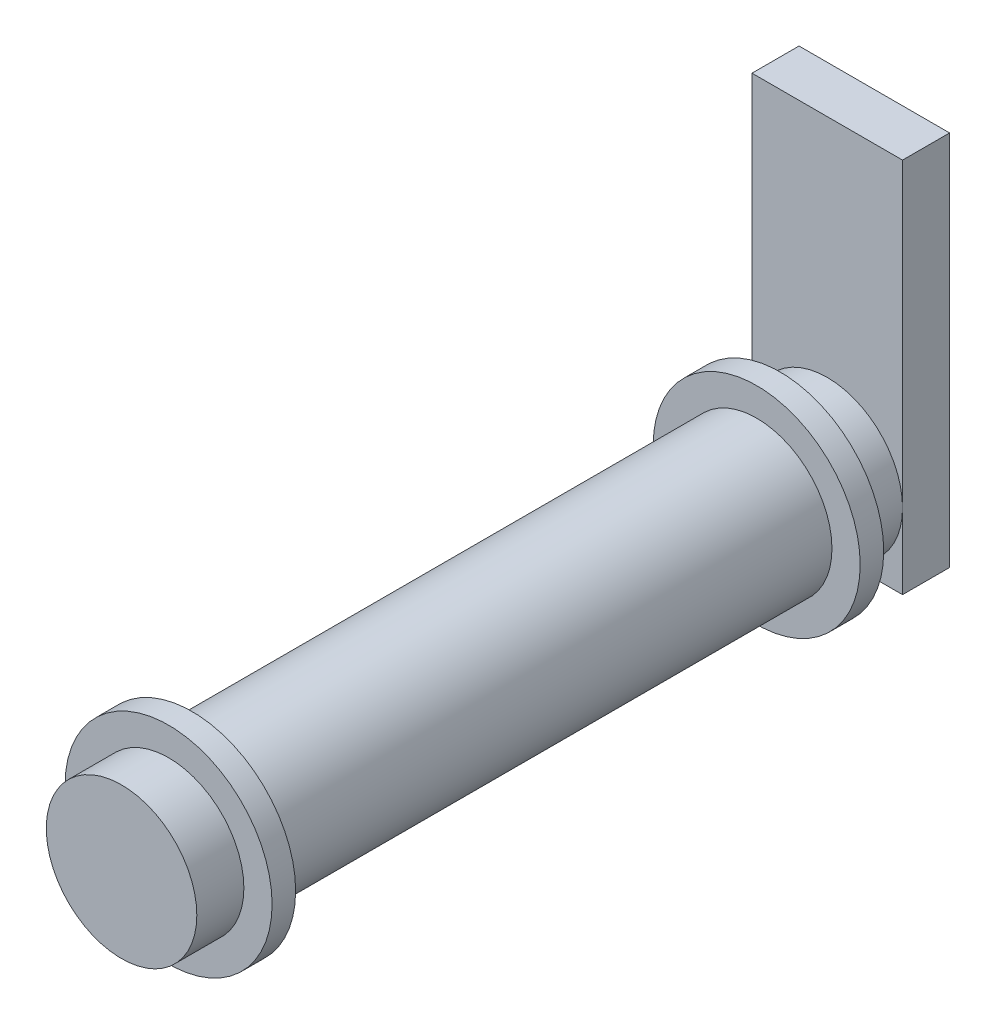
ISO-10303-21;
HEADER;
FILE_DESCRIPTION(('STEP AP214'),'2;1');
FILE_NAME('part.step','',(''),(''),'','','');
FILE_SCHEMA(('AUTOMOTIVE_DESIGN { 1 0 10303 214 1 1 1 1 }'));
ENDSEC;
DATA;
#1=APPLICATION_CONTEXT('core data for automotive mechanical design processes');
#2=APPLICATION_PROTOCOL_DEFINITION('international standard','automotive_design',2000,#1);
#3=PRODUCT_CONTEXT('',#1,'mechanical');
#4=PRODUCT('Part','Part','',(#3));
#5=PRODUCT_RELATED_PRODUCT_CATEGORY('part','',(#4));
#6=PRODUCT_DEFINITION_FORMATION('','',#4);
#7=PRODUCT_DEFINITION_CONTEXT('part definition',#1,'design');
#8=PRODUCT_DEFINITION('design','',#6,#7);
#9=PRODUCT_DEFINITION_SHAPE('','',#8);
#10=(LENGTH_UNIT() NAMED_UNIT(*) SI_UNIT(.MILLI.,.METRE.));
#11=(NAMED_UNIT(*) PLANE_ANGLE_UNIT() SI_UNIT($,.RADIAN.));
#12=(NAMED_UNIT(*) SI_UNIT($,.STERADIAN.) SOLID_ANGLE_UNIT());
#13=UNCERTAINTY_MEASURE_WITH_UNIT(LENGTH_MEASURE(1.E-05),#10,'distance_accuracy_value','');
#14=(GEOMETRIC_REPRESENTATION_CONTEXT(3) GLOBAL_UNCERTAINTY_ASSIGNED_CONTEXT((#13)) GLOBAL_UNIT_ASSIGNED_CONTEXT((#10,
#11,#12)) REPRESENTATION_CONTEXT('',''));
#15=CARTESIAN_POINT('',(0.,0.,0.));
#16=DIRECTION('',(0.,0.,1.));
#17=DIRECTION('',(1.,0.,0.));
#18=AXIS2_PLACEMENT_3D('',#15,#16,#17);
#19=CARTESIAN_POINT('',(0.,0.,150.));
#20=DIRECTION('',(0.,0.,-1.));
#21=DIRECTION('',(-1.,0.,0.));
#22=AXIS2_PLACEMENT_3D('',#19,#20,#21);
#23=CYLINDRICAL_SURFACE('',#22,16.);
#24=CARTESIAN_POINT('',(0.,0.,15.));
#25=DIRECTION('',(0.,0.,1.));
#26=DIRECTION('',(1.,0.,0.));
#27=AXIS2_PLACEMENT_3D('',#24,#25,#26);
#28=CIRCLE('',#27,16.);
#29=CARTESIAN_POINT('',(16.,0.,15.));
#30=VERTEX_POINT('',#29);
#31=EDGE_CURVE('E122',#30,#30,#28,.T.);
#32=ORIENTED_EDGE('',*,*,#31,.T.);
#33=EDGE_LOOP('',(#32));
#34=FACE_BOUND('',#33,.T.);
#35=CARTESIAN_POINT('',(0.,0.,135.));
#36=DIRECTION('',(0.,0.,1.));
#37=DIRECTION('',(1.,0.,0.));
#38=AXIS2_PLACEMENT_3D('',#35,#36,#37);
#39=CIRCLE('',#38,16.);
#40=CARTESIAN_POINT('',(16.,0.,135.));
#41=VERTEX_POINT('',#40);
#42=EDGE_CURVE('E11',#41,#41,#39,.T.);
#43=ORIENTED_EDGE('',*,*,#42,.F.);
#44=EDGE_LOOP('',(#43));
#45=FACE_BOUND('',#44,.T.);
#46=ADVANCED_FACE('F33',(#34,#45),#23,.T.);
#47=CARTESIAN_POINT('',(0.,0.,0.));
#48=DIRECTION('',(0.,0.,1.));
#49=DIRECTION('',(1.,0.,0.));
#50=AXIS2_PLACEMENT_3D('',#47,#48,#49);
#51=CIRCLE('',#50,16.);
#52=CARTESIAN_POINT('',(16.,0.,0.));
#53=VERTEX_POINT('',#52);
#54=CARTESIAN_POINT('',(-16.,0.,0.));
#55=VERTEX_POINT('',#54);
#56=EDGE_CURVE('E111',#53,#55,#51,.T.);
#57=ORIENTED_EDGE('',*,*,#56,.T.);
#58=CARTESIAN_POINT('',(0.,-16.,0.));
#59=VERTEX_POINT('',#58);
#60=EDGE_CURVE('E109',#55,#59,#51,.T.);
#61=ORIENTED_EDGE('',*,*,#60,.T.);
#62=EDGE_CURVE('E56',#59,#53,#51,.T.);
#63=ORIENTED_EDGE('',*,*,#62,.T.);
#64=EDGE_LOOP('',(#57,#61,#63));
#65=FACE_BOUND('',#64,.T.);
#66=CARTESIAN_POINT('',(0.,0.,10.));
#67=DIRECTION('',(0.,0.,1.));
#68=DIRECTION('',(1.,0.,0.));
#69=AXIS2_PLACEMENT_3D('',#66,#67,#68);
#70=CIRCLE('',#69,16.);
#71=CARTESIAN_POINT('',(16.,0.,10.));
#72=VERTEX_POINT('',#71);
#73=EDGE_CURVE('E42',#72,#72,#70,.T.);
#74=ORIENTED_EDGE('',*,*,#73,.F.);
#75=EDGE_LOOP('',(#74));
#76=FACE_BOUND('',#75,.T.);
#77=ADVANCED_FACE('F162',(#65,#76),#23,.T.);
#78=CARTESIAN_POINT('',(16.,64.,0.));
#79=DIRECTION('',(0.,0.,1.));
#80=DIRECTION('',(1.,0.,0.));
#81=AXIS2_PLACEMENT_3D('',#78,#79,#80);
#82=PLANE('',#81);
#83=ORIENTED_EDGE('',*,*,#56,.F.);
#84=DIRECTION('',(0.,-1.,0.));
#85=VECTOR('',#84,1.);
#86=CARTESIAN_POINT('',(16.,-16.,0.));
#87=LINE('',#86,#85);
#88=CARTESIAN_POINT('',(16.,64.,0.));
#89=VERTEX_POINT('',#88);
#90=EDGE_CURVE('E49',#89,#53,#87,.T.);
#91=ORIENTED_EDGE('',*,*,#90,.F.);
#92=DIRECTION('',(1.,0.,0.));
#93=VECTOR('',#92,1.);
#94=CARTESIAN_POINT('',(16.,64.,0.));
#95=LINE('',#94,#93);
#96=CARTESIAN_POINT('',(-16.,64.,0.));
#97=VERTEX_POINT('',#96);
#98=EDGE_CURVE('E104',#97,#89,#95,.T.);
#99=ORIENTED_EDGE('',*,*,#98,.F.);
#100=DIRECTION('',(0.,1.,0.));
#101=VECTOR('',#100,1.);
#102=CARTESIAN_POINT('',(-16.,-16.,0.));
#103=LINE('',#102,#101);
#104=EDGE_CURVE('E145',#55,#97,#103,.T.);
#105=ORIENTED_EDGE('',*,*,#104,.F.);
#106=EDGE_LOOP('',(#83,#91,#99,#105));
#107=FACE_BOUND('',#106,.T.);
#108=ADVANCED_FACE('F159',(#107),#82,.T.);
#109=ORIENTED_EDGE('',*,*,#60,.F.);
#110=CARTESIAN_POINT('',(-16.,-16.,0.));
#111=VERTEX_POINT('',#110);
#112=EDGE_CURVE('E146',#111,#55,#103,.T.);
#113=ORIENTED_EDGE('',*,*,#112,.F.);
#114=DIRECTION('',(-1.,0.,0.));
#115=VECTOR('',#114,1.);
#116=CARTESIAN_POINT('',(16.,-16.,0.));
#117=LINE('',#116,#115);
#118=EDGE_CURVE('E142',#59,#111,#117,.T.);
#119=ORIENTED_EDGE('',*,*,#118,.F.);
#120=EDGE_LOOP('',(#109,#113,#119));
#121=FACE_BOUND('',#120,.T.);
#122=ADVANCED_FACE('F166',(#121),#82,.T.);
#123=ORIENTED_EDGE('',*,*,#62,.F.);
#124=CARTESIAN_POINT('',(16.,-16.,0.));
#125=VERTEX_POINT('',#124);
#126=EDGE_CURVE('E143',#125,#59,#117,.T.);
#127=ORIENTED_EDGE('',*,*,#126,.F.);
#128=EDGE_CURVE('E107',#53,#125,#87,.T.);
#129=ORIENTED_EDGE('',*,*,#128,.F.);
#130=EDGE_LOOP('',(#123,#127,#129));
#131=FACE_BOUND('',#130,.T.);
#132=ADVANCED_FACE('F167',(#131),#82,.T.);
#133=CARTESIAN_POINT('',(16.,-16.,-10.));
#134=DIRECTION('',(-1.,0.,0.));
#135=DIRECTION('',(0.,0.,1.));
#136=AXIS2_PLACEMENT_3D('',#133,#134,#135);
#137=PLANE('',#136);
#138=ORIENTED_EDGE('',*,*,#90,.T.);
#139=ORIENTED_EDGE('',*,*,#128,.T.);
#140=DIRECTION('',(0.,0.,1.));
#141=VECTOR('',#140,1.);
#142=CARTESIAN_POINT('',(16.,-16.,-10.));
#143=LINE('',#142,#141);
#144=CARTESIAN_POINT('',(16.,-16.,-10.));
#145=VERTEX_POINT('',#144);
#146=EDGE_CURVE('E91',#145,#125,#143,.T.);
#147=ORIENTED_EDGE('',*,*,#146,.F.);
#148=DIRECTION('',(0.,-1.,0.));
#149=VECTOR('',#148,1.);
#150=CARTESIAN_POINT('',(16.,-16.,-10.));
#151=LINE('',#150,#149);
#152=CARTESIAN_POINT('',(16.,64.,-10.));
#153=VERTEX_POINT('',#152);
#154=EDGE_CURVE('E97',#153,#145,#151,.T.);
#155=ORIENTED_EDGE('',*,*,#154,.F.);
#156=DIRECTION('',(0.,0.,1.));
#157=VECTOR('',#156,1.);
#158=CARTESIAN_POINT('',(16.,64.,-10.));
#159=LINE('',#158,#157);
#160=EDGE_CURVE('E140',#153,#89,#159,.T.);
#161=ORIENTED_EDGE('',*,*,#160,.T.);
#162=EDGE_LOOP('',(#138,#139,#147,#155,#161));
#163=FACE_BOUND('',#162,.T.);
#164=ADVANCED_FACE('F106',(#163),#137,.F.);
#165=CARTESIAN_POINT('',(16.,-16.,-10.));
#166=DIRECTION('',(0.,1.,0.));
#167=DIRECTION('',(0.,0.,1.));
#168=AXIS2_PLACEMENT_3D('',#165,#166,#167);
#169=PLANE('',#168);
#170=ORIENTED_EDGE('',*,*,#126,.T.);
#171=ORIENTED_EDGE('',*,*,#118,.T.);
#172=DIRECTION('',(0.,0.,1.));
#173=VECTOR('',#172,1.);
#174=CARTESIAN_POINT('',(-16.,-16.,-10.));
#175=LINE('',#174,#173);
#176=CARTESIAN_POINT('',(-16.,-16.,-10.));
#177=VERTEX_POINT('',#176);
#178=EDGE_CURVE('E93',#177,#111,#175,.T.);
#179=ORIENTED_EDGE('',*,*,#178,.F.);
#180=DIRECTION('',(-1.,0.,0.));
#181=VECTOR('',#180,1.);
#182=CARTESIAN_POINT('',(16.,-16.,-10.));
#183=LINE('',#182,#181);
#184=EDGE_CURVE('E86',#145,#177,#183,.T.);
#185=ORIENTED_EDGE('',*,*,#184,.F.);
#186=ORIENTED_EDGE('',*,*,#146,.T.);
#187=EDGE_LOOP('',(#170,#171,#179,#185,#186));
#188=FACE_BOUND('',#187,.T.);
#189=ADVANCED_FACE('F89',(#188),#169,.F.);
#190=CARTESIAN_POINT('',(-16.,-16.,-10.));
#191=DIRECTION('',(1.,0.,0.));
#192=DIRECTION('',(0.,1.,0.));
#193=AXIS2_PLACEMENT_3D('',#190,#191,#192);
#194=PLANE('',#193);
#195=ORIENTED_EDGE('',*,*,#112,.T.);
#196=ORIENTED_EDGE('',*,*,#104,.T.);
#197=DIRECTION('',(0.,0.,1.));
#198=VECTOR('',#197,1.);
#199=CARTESIAN_POINT('',(-16.,64.,-10.));
#200=LINE('',#199,#198);
#201=CARTESIAN_POINT('',(-16.,64.,-10.));
#202=VERTEX_POINT('',#201);
#203=EDGE_CURVE('E112',#202,#97,#200,.T.);
#204=ORIENTED_EDGE('',*,*,#203,.F.);
#205=DIRECTION('',(0.,1.,0.));
#206=VECTOR('',#205,1.);
#207=CARTESIAN_POINT('',(-16.,-16.,-10.));
#208=LINE('',#207,#206);
#209=EDGE_CURVE('E96',#177,#202,#208,.T.);
#210=ORIENTED_EDGE('',*,*,#209,.F.);
#211=ORIENTED_EDGE('',*,*,#178,.T.);
#212=EDGE_LOOP('',(#195,#196,#204,#210,#211));
#213=FACE_BOUND('',#212,.T.);
#214=ADVANCED_FACE('F232',(#213),#194,.F.);
#215=CARTESIAN_POINT('',(16.,64.,-10.));
#216=DIRECTION('',(0.,-1.,0.));
#217=DIRECTION('',(0.,0.,-1.));
#218=AXIS2_PLACEMENT_3D('',#215,#216,#217);
#219=PLANE('',#218);
#220=ORIENTED_EDGE('',*,*,#98,.T.);
#221=ORIENTED_EDGE('',*,*,#160,.F.);
#222=DIRECTION('',(1.,0.,0.));
#223=VECTOR('',#222,1.);
#224=CARTESIAN_POINT('',(16.,64.,-10.));
#225=LINE('',#224,#223);
#226=EDGE_CURVE('E102',#202,#153,#225,.T.);
#227=ORIENTED_EDGE('',*,*,#226,.F.);
#228=ORIENTED_EDGE('',*,*,#203,.T.);
#229=EDGE_LOOP('',(#220,#221,#227,#228));
#230=FACE_BOUND('',#229,.T.);
#231=ADVANCED_FACE('F154',(#230),#219,.F.);
#232=CARTESIAN_POINT('',(16.,64.,-10.));
#233=DIRECTION('',(0.,0.,1.));
#234=DIRECTION('',(1.,0.,0.));
#235=AXIS2_PLACEMENT_3D('',#232,#233,#234);
#236=PLANE('',#235);
#237=ORIENTED_EDGE('',*,*,#154,.T.);
#238=ORIENTED_EDGE('',*,*,#184,.T.);
#239=ORIENTED_EDGE('',*,*,#209,.T.);
#240=ORIENTED_EDGE('',*,*,#226,.T.);
#241=EDGE_LOOP('',(#237,#238,#239,#240));
#242=FACE_BOUND('',#241,.T.);
#243=ADVANCED_FACE('F100',(#242),#236,.F.);
#244=CARTESIAN_POINT('',(0.,0.,15.));
#245=DIRECTION('',(0.,0.,1.));
#246=DIRECTION('',(1.,0.,0.));
#247=AXIS2_PLACEMENT_3D('',#244,#245,#246);
#248=PLANE('',#247);
#249=CARTESIAN_POINT('',(0.,0.,15.));
#250=DIRECTION('',(0.,0.,1.));
#251=DIRECTION('',(1.,0.,0.));
#252=AXIS2_PLACEMENT_3D('',#249,#250,#251);
#253=CIRCLE('',#252,22.);
#254=CARTESIAN_POINT('',(22.,0.,15.));
#255=VERTEX_POINT('',#254);
#256=EDGE_CURVE('E124',#255,#255,#253,.T.);
#257=ORIENTED_EDGE('',*,*,#256,.T.);
#258=EDGE_LOOP('',(#257));
#259=FACE_BOUND('',#258,.T.);
#260=ORIENTED_EDGE('',*,*,#31,.F.);
#261=EDGE_LOOP('',(#260));
#262=FACE_BOUND('',#261,.T.);
#263=ADVANCED_FACE('F219',(#259,#262),#248,.T.);
#264=CARTESIAN_POINT('',(0.,0.,10.));
#265=DIRECTION('',(0.,0.,1.));
#266=DIRECTION('',(1.,0.,0.));
#267=AXIS2_PLACEMENT_3D('',#264,#265,#266);
#268=PLANE('',#267);
#269=CARTESIAN_POINT('',(0.,0.,10.));
#270=DIRECTION('',(0.,0.,1.));
#271=DIRECTION('',(1.,0.,0.));
#272=AXIS2_PLACEMENT_3D('',#269,#270,#271);
#273=CIRCLE('',#272,22.);
#274=CARTESIAN_POINT('',(22.,0.,10.));
#275=VERTEX_POINT('',#274);
#276=EDGE_CURVE('E129',#275,#275,#273,.T.);
#277=ORIENTED_EDGE('',*,*,#276,.F.);
#278=EDGE_LOOP('',(#277));
#279=FACE_BOUND('',#278,.T.);
#280=ORIENTED_EDGE('',*,*,#73,.T.);
#281=EDGE_LOOP('',(#280));
#282=FACE_BOUND('',#281,.T.);
#283=ADVANCED_FACE('F222',(#279,#282),#268,.F.);
#284=CARTESIAN_POINT('',(0.,0.,15.));
#285=DIRECTION('',(0.,0.,-1.));
#286=DIRECTION('',(-1.,0.,0.));
#287=AXIS2_PLACEMENT_3D('',#284,#285,#286);
#288=CYLINDRICAL_SURFACE('',#287,22.);
#289=ORIENTED_EDGE('',*,*,#256,.F.);
#290=EDGE_LOOP('',(#289));
#291=FACE_BOUND('',#290,.T.);
#292=ORIENTED_EDGE('',*,*,#276,.T.);
#293=EDGE_LOOP('',(#292));
#294=FACE_BOUND('',#293,.T.);
#295=ADVANCED_FACE('F216',(#291,#294),#288,.T.);
#296=CARTESIAN_POINT('',(0.,0.,140.));
#297=DIRECTION('',(0.,0.,1.));
#298=DIRECTION('',(1.,0.,0.));
#299=AXIS2_PLACEMENT_3D('',#296,#297,#298);
#300=PLANE('',#299);
#301=CARTESIAN_POINT('',(0.,0.,140.));
#302=DIRECTION('',(0.,0.,1.));
#303=DIRECTION('',(1.,0.,0.));
#304=AXIS2_PLACEMENT_3D('',#301,#302,#303);
#305=CIRCLE('',#304,22.);
#306=CARTESIAN_POINT('',(22.,0.,140.));
#307=VERTEX_POINT('',#306);
#308=EDGE_CURVE('E196',#307,#307,#305,.T.);
#309=ORIENTED_EDGE('',*,*,#308,.T.);
#310=EDGE_LOOP('',(#309));
#311=FACE_BOUND('',#310,.T.);
#312=CARTESIAN_POINT('',(0.,0.,140.));
#313=DIRECTION('',(0.,0.,1.));
#314=DIRECTION('',(1.,0.,0.));
#315=AXIS2_PLACEMENT_3D('',#312,#313,#314);
#316=CIRCLE('',#315,16.);
#317=CARTESIAN_POINT('',(16.,0.,140.));
#318=VERTEX_POINT('',#317);
#319=EDGE_CURVE('E37',#318,#318,#316,.T.);
#320=ORIENTED_EDGE('',*,*,#319,.F.);
#321=EDGE_LOOP('',(#320));
#322=FACE_BOUND('',#321,.T.);
#323=ADVANCED_FACE('F207',(#311,#322),#300,.T.);
#324=CARTESIAN_POINT('',(0.,0.,135.));
#325=DIRECTION('',(0.,0.,1.));
#326=DIRECTION('',(1.,0.,0.));
#327=AXIS2_PLACEMENT_3D('',#324,#325,#326);
#328=PLANE('',#327);
#329=CARTESIAN_POINT('',(0.,0.,135.));
#330=DIRECTION('',(0.,0.,1.));
#331=DIRECTION('',(1.,0.,0.));
#332=AXIS2_PLACEMENT_3D('',#329,#330,#331);
#333=CIRCLE('',#332,22.);
#334=CARTESIAN_POINT('',(22.,0.,135.));
#335=VERTEX_POINT('',#334);
#336=EDGE_CURVE('E136',#335,#335,#333,.T.);
#337=ORIENTED_EDGE('',*,*,#336,.F.);
#338=EDGE_LOOP('',(#337));
#339=FACE_BOUND('',#338,.T.);
#340=ORIENTED_EDGE('',*,*,#42,.T.);
#341=EDGE_LOOP('',(#340));
#342=FACE_BOUND('',#341,.T.);
#343=ADVANCED_FACE('F204',(#339,#342),#328,.F.);
#344=CARTESIAN_POINT('',(0.,0.,140.));
#345=DIRECTION('',(0.,0.,-1.));
#346=DIRECTION('',(-1.,0.,0.));
#347=AXIS2_PLACEMENT_3D('',#344,#345,#346);
#348=CYLINDRICAL_SURFACE('',#347,22.);
#349=ORIENTED_EDGE('',*,*,#308,.F.);
#350=EDGE_LOOP('',(#349));
#351=FACE_BOUND('',#350,.T.);
#352=ORIENTED_EDGE('',*,*,#336,.T.);
#353=EDGE_LOOP('',(#352));
#354=FACE_BOUND('',#353,.T.);
#355=ADVANCED_FACE('F189',(#351,#354),#348,.T.);
#356=CARTESIAN_POINT('',(0.,0.,150.));
#357=DIRECTION('',(0.,0.,1.));
#358=DIRECTION('',(1.,0.,0.));
#359=AXIS2_PLACEMENT_3D('',#356,#357,#358);
#360=PLANE('',#359);
#361=CARTESIAN_POINT('',(0.,0.,150.));
#362=DIRECTION('',(0.,0.,1.));
#363=DIRECTION('',(1.,0.,0.));
#364=AXIS2_PLACEMENT_3D('',#361,#362,#363);
#365=CIRCLE('',#364,16.);
#366=CARTESIAN_POINT('',(16.,0.,150.));
#367=VERTEX_POINT('',#366);
#368=EDGE_CURVE('E116',#367,#367,#365,.T.);
#369=ORIENTED_EDGE('',*,*,#368,.T.);
#370=EDGE_LOOP('',(#369));
#371=FACE_BOUND('',#370,.T.);
#372=ADVANCED_FACE('F184',(#371),#360,.T.);
#373=ORIENTED_EDGE('',*,*,#319,.T.);
#374=EDGE_LOOP('',(#373));
#375=FACE_BOUND('',#374,.T.);
#376=ORIENTED_EDGE('',*,*,#368,.F.);
#377=EDGE_LOOP('',(#376));
#378=FACE_BOUND('',#377,.T.);
#379=ADVANCED_FACE('F35',(#375,#378),#23,.T.);
#380=CLOSED_SHELL('',(#46,#77,#108,#122,#132,#164,#189,#214,#231,#243,#263,#283,#295,#323,#343,
#355,#372,#379));
#381=MANIFOLD_SOLID_BREP('B2',#380);
#382=ADVANCED_BREP_SHAPE_REPRESENTATION('',(#18,#381),#14);
#383=SHAPE_DEFINITION_REPRESENTATION(#9,#382);
ENDSEC;
END-ISO-10303-21;
